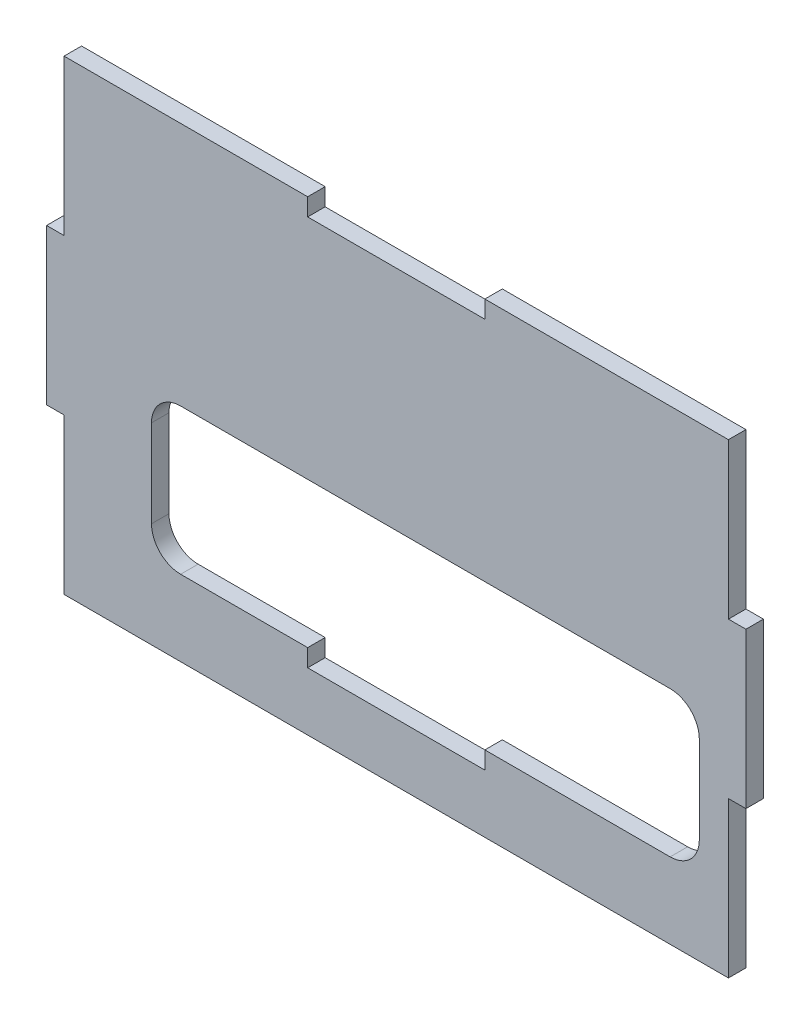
from build123d import *

# Parameters (mm, degrees)
SKETCH1_W           = 120
SKETCH1_H           = 80
BOSS_EXTRUDE1_DEPTH = 3
SKETCH2_W           = 30.4
SKETCH2_H           = 3
CUT_EXTRUDE1_DEPTH  = 3
SKETCH3_W           = 3
SKETCH3_H           = 26.666666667
CUT_EXTRUDE2_DEPTH  = 3
SKETCH4_W           = 94
SKETCH4_H           = 25
CUT_EXTRUDE3_DEPTH  = 3
FILLET1_R           = 5
LPATTERN1_COUNT     = 2
LPATTERN1_PITCH     = 67


with BuildPart() as part:
    # Sketch1 → Boss-Extrude1 (new body)
    with BuildSketch(Plane.XY):
        Rectangle(SKETCH1_W, SKETCH1_H)
    extrude(amount=BOSS_EXTRUDE1_DEPTH)

    # Sketch2 → Cut-Extrude1 (cut)
    with BuildSketch(Plane.XY.offset(3)):
        with Locations((0, -28.5)):
            Rectangle(SKETCH2_W, SKETCH2_H)
    cut_extrude1 = extrude(amount=-CUT_EXTRUDE1_DEPTH, mode=Mode.SUBTRACT)

    # Sketch3 → Cut-Extrude2 (cut)
    with BuildSketch(Plane.XY.offset(3)):
        with Locations((-58.5, 26.666666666)):
            Rectangle(SKETCH3_W, SKETCH3_H)
        with Locations((-58.5, -26.666666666)):
            Rectangle(SKETCH3_W, SKETCH3_H)
    cut_extrude2 = extrude(amount=-CUT_EXTRUDE2_DEPTH, mode=Mode.SUBTRACT)

    # Mirror1: Cut-Extrude2 across plane
    add(cut_extrude2.mirror(Plane(origin=(0, 0, 0), x_dir=(0, 0, 1), z_dir=(1, 0, 0))), mode=Mode.SUBTRACT)

    # Sketch4 → Cut-Extrude3 (cut)
    with BuildSketch(Plane.XY.offset(3)):
        with Locations((5, -14.5)):
            Rectangle(SKETCH4_W, SKETCH4_H)
    extrude(amount=-CUT_EXTRUDE3_DEPTH, mode=Mode.SUBTRACT)

    # Fillet1
    fillet1_edges = [part.edges().sort_by_distance(p)[0] for p in [
        (-42, -27, 1.5),
        (-42, -2, 1.5),
        (52, -2, 1.5),
        (52, -27, 1.5),
    ]]
    fillet(fillet1_edges, radius=FILLET1_R)

    # LPattern1: Cut-Extrude1 ×2
    with Locations(*[(0, i * LPATTERN1_PITCH, 0) for i in range(1, LPATTERN1_COUNT)]):
        add(cut_extrude1, mode=Mode.SUBTRACT)


solid = part.part
